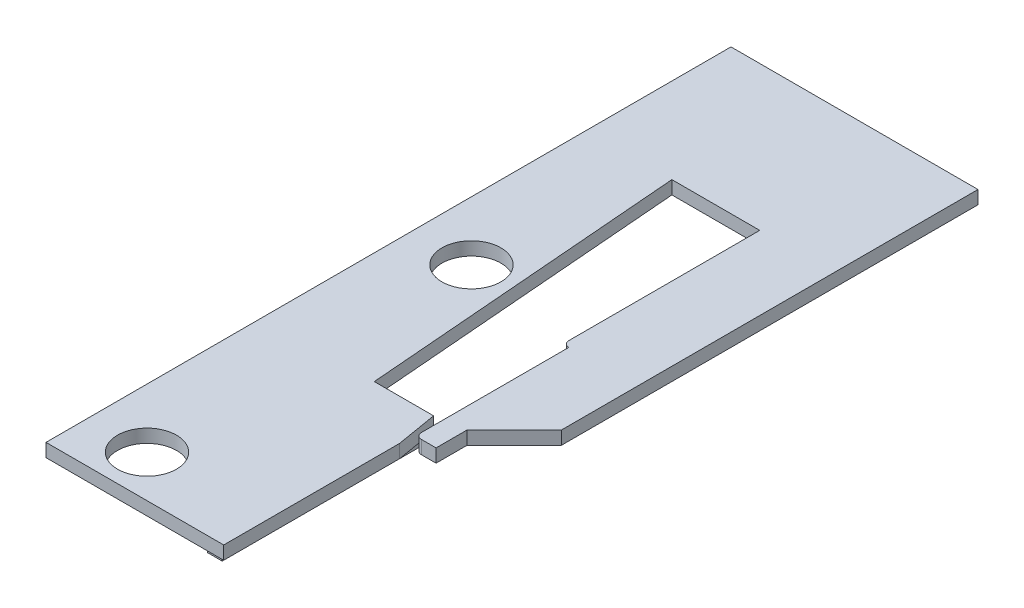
from build123d import *

# Parameters (mm, degrees)
SKETCH11_R          = 2
BOSS_EXTRUDE1_DEPTH = 0.9
SKETCH13_W          = 1
SKETCH13_H          = 14
BOSS_EXTRUDE3_DEPTH = 0.4


with BuildPart() as part:
    # Sketch11 → Boss-Extrude1 (new body)
    with BuildSketch(Plane(origin=(0, 0, 0), x_dir=(1, 0, 0), z_dir=(0, 1, 0))):
        with BuildLine():
            Line((43.65, 1.2), (46.85, 4.4))
            Line((46.85, 4.4), (46.85, 32.65))
            Line((46.85, 32.65), (30.1, 32.65))
            Line((30.1, 32.65), (30.1, -13.8))
            Line((30.1, -13.8), (42.15, -13.8))
            Line((42.15, -13.8), (42.15, -1.873333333))
            Line((42.15, -1.873333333), (41.68258427, 0.9))
            Line((41.68258427, 0.9), (37.661490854, 0.9))
            Line((37.661490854, 0.9), (35.89161222, 22.85))
            Line((35.89161222, 22.85), (41.85, 22.85))
            Line((41.85, 22.85), (41.85, 9.9))
            ThreePointArc((41.85, 9.9), (41.967157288, 9.617157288), (42.25, 9.5))
            Line((42.25, 9.5), (42.25, 8.3))
            Line((42.25, 8.3), (42.25, -0.5))
            ThreePointArc((42.25, -0.5), (42.367157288, -0.782842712), (42.65, -0.9))
            Line((42.65, -0.9), (43.65, -0.9))
            Line((43.65, -0.9), (43.65, 1.2))
        make_face()
        with Locations(Location((34.1, -10.95, 0), (0, 0, 270))):
            Circle(SKETCH11_R, mode=Mode.SUBTRACT)
        with Locations(Location((34.1, 11.05, 0), (0, 0, 270))):
            Circle(SKETCH11_R, mode=Mode.SUBTRACT)
    extrude(amount=BOSS_EXTRUDE1_DEPTH)

    # Sketch13 → Boss-Extrude3 (add)
    with BuildSketch(Plane(origin=(0, 0, 0), x_dir=(1, 0, 0), z_dir=(0, 1, 0))):
        with Locations((42.75, 6.5)):
            Rectangle(SKETCH13_W, SKETCH13_H)
        with Locations((41.25, -6.5)):
            Rectangle(SKETCH13_W, SKETCH13_H)
    extrude(amount=-BOSS_EXTRUDE3_DEPTH)


solid = part.part
